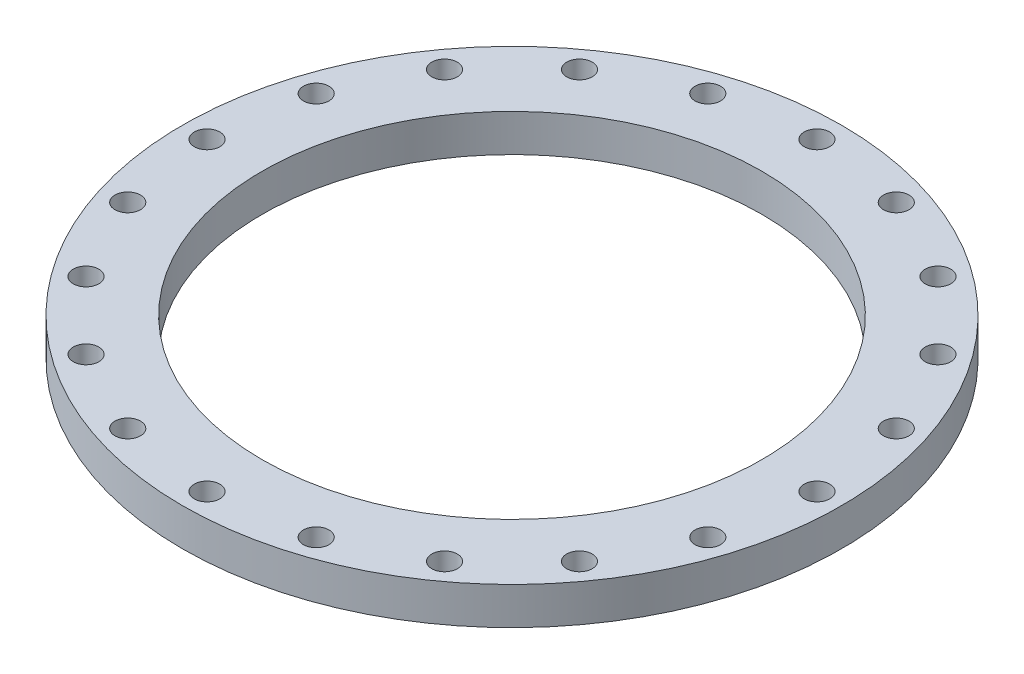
ISO-10303-21;
HEADER;
FILE_DESCRIPTION(('STEP AP214'),'2;1');
FILE_NAME('part.step','',(''),(''),'','','');
FILE_SCHEMA(('AUTOMOTIVE_DESIGN { 1 0 10303 214 1 1 1 1 }'));
ENDSEC;
DATA;
#1=APPLICATION_CONTEXT('core data for automotive mechanical design processes');
#2=APPLICATION_PROTOCOL_DEFINITION('international standard','automotive_design',2000,#1);
#3=PRODUCT_CONTEXT('',#1,'mechanical');
#4=PRODUCT('Part','Part','',(#3));
#5=PRODUCT_RELATED_PRODUCT_CATEGORY('part','',(#4));
#6=PRODUCT_DEFINITION_FORMATION('','',#4);
#7=PRODUCT_DEFINITION_CONTEXT('part definition',#1,'design');
#8=PRODUCT_DEFINITION('design','',#6,#7);
#9=PRODUCT_DEFINITION_SHAPE('','',#8);
#10=(LENGTH_UNIT() NAMED_UNIT(*) SI_UNIT(.MILLI.,.METRE.));
#11=(NAMED_UNIT(*) PLANE_ANGLE_UNIT() SI_UNIT($,.RADIAN.));
#12=(NAMED_UNIT(*) SI_UNIT($,.STERADIAN.) SOLID_ANGLE_UNIT());
#13=UNCERTAINTY_MEASURE_WITH_UNIT(LENGTH_MEASURE(1.E-05),#10,'distance_accuracy_value','');
#14=(GEOMETRIC_REPRESENTATION_CONTEXT(3) GLOBAL_UNCERTAINTY_ASSIGNED_CONTEXT((#13)) GLOBAL_UNIT_ASSIGNED_CONTEXT((#10,
#11,#12)) REPRESENTATION_CONTEXT('',''));
#15=CARTESIAN_POINT('',(0.,0.,0.));
#16=DIRECTION('',(0.,0.,1.));
#17=DIRECTION('',(1.,0.,0.));
#18=AXIS2_PLACEMENT_3D('',#15,#16,#17);
#19=CARTESIAN_POINT('',(0.,0.,0.));
#20=DIRECTION('',(0.,1.,0.));
#21=DIRECTION('',(0.,0.,1.));
#22=AXIS2_PLACEMENT_3D('',#19,#20,#21);
#23=CYLINDRICAL_SURFACE('',#22,335.);
#24=CARTESIAN_POINT('',(0.,0.,0.));
#25=DIRECTION('',(0.,1.,0.));
#26=DIRECTION('',(0.,0.,-1.));
#27=AXIS2_PLACEMENT_3D('',#24,#25,#26);
#28=CIRCLE('',#27,335.);
#29=CARTESIAN_POINT('',(0.,0.,-335.));
#30=VERTEX_POINT('',#29);
#31=EDGE_CURVE('E10',#30,#30,#28,.T.);
#32=ORIENTED_EDGE('',*,*,#31,.T.);
#33=EDGE_LOOP('',(#32));
#34=FACE_BOUND('',#33,.T.);
#35=CARTESIAN_POINT('',(0.,38.,0.));
#36=DIRECTION('',(0.,1.,0.));
#37=DIRECTION('',(0.,0.,-1.));
#38=AXIS2_PLACEMENT_3D('',#35,#36,#37);
#39=CIRCLE('',#38,335.);
#40=CARTESIAN_POINT('',(0.,38.,-335.));
#41=VERTEX_POINT('',#40);
#42=EDGE_CURVE('E34',#41,#41,#39,.T.);
#43=ORIENTED_EDGE('',*,*,#42,.F.);
#44=EDGE_LOOP('',(#43));
#45=FACE_BOUND('',#44,.T.);
#46=ADVANCED_FACE('F31',(#34,#45),#23,.T.);
#47=CARTESIAN_POINT('',(0.,0.,0.));
#48=DIRECTION('',(0.,-1.,0.));
#49=DIRECTION('',(0.,0.,-1.));
#50=AXIS2_PLACEMENT_3D('',#47,#48,#49);
#51=PLANE('',#50);
#52=CARTESIAN_POINT('',(0.,0.,0.));
#53=DIRECTION('',(0.,1.,0.));
#54=DIRECTION('',(0.,0.,-1.));
#55=AXIS2_PLACEMENT_3D('',#52,#53,#54);
#56=CIRCLE('',#55,254.);
#57=CARTESIAN_POINT('',(0.,0.,-254.));
#58=VERTEX_POINT('',#57);
#59=EDGE_CURVE('E160',#58,#58,#56,.T.);
#60=ORIENTED_EDGE('',*,*,#59,.T.);
#61=EDGE_LOOP('',(#60));
#62=FACE_BOUND('',#61,.T.);
#63=CARTESIAN_POINT('',(310.,0.,0.));
#64=DIRECTION('',(0.,1.,0.));
#65=DIRECTION('',(0.,0.,-1.));
#66=AXIS2_PLACEMENT_3D('',#63,#64,#65);
#67=CIRCLE('',#66,13.);
#68=CARTESIAN_POINT('',(310.,0.,-13.));
#69=VERTEX_POINT('',#68);
#70=EDGE_CURVE('E154',#69,#69,#67,.T.);
#71=ORIENTED_EDGE('',*,*,#70,.T.);
#72=EDGE_LOOP('',(#71));
#73=FACE_BOUND('',#72,.T.);
#74=CARTESIAN_POINT('',(294.827520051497,0.,-95.7952682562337));
#75=DIRECTION('',(0.,1.,0.));
#76=DIRECTION('',(0.,0.,-1.));
#77=AXIS2_PLACEMENT_3D('',#74,#75,#76);
#78=CIRCLE('',#77,13.);
#79=CARTESIAN_POINT('',(294.827520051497,0.,-108.795268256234));
#80=VERTEX_POINT('',#79);
#81=EDGE_CURVE('E148',#80,#80,#78,.T.);
#82=ORIENTED_EDGE('',*,*,#81,.T.);
#83=EDGE_LOOP('',(#82));
#84=FACE_BOUND('',#83,.T.);
#85=CARTESIAN_POINT('',(250.795268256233,0.,-182.213428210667));
#86=DIRECTION('',(0.,1.,0.));
#87=DIRECTION('',(0.,0.,-1.));
#88=AXIS2_PLACEMENT_3D('',#85,#86,#87);
#89=CIRCLE('',#88,13.);
#90=CARTESIAN_POINT('',(250.795268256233,0.,-195.213428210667));
#91=VERTEX_POINT('',#90);
#92=EDGE_CURVE('E142',#91,#91,#89,.T.);
#93=ORIENTED_EDGE('',*,*,#92,.T.);
#94=EDGE_LOOP('',(#93));
#95=FACE_BOUND('',#94,.T.);
#96=CARTESIAN_POINT('',(182.213428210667,0.,-250.795268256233));
#97=DIRECTION('',(0.,1.,0.));
#98=DIRECTION('',(0.,0.,-1.));
#99=AXIS2_PLACEMENT_3D('',#96,#97,#98);
#100=CIRCLE('',#99,13.);
#101=CARTESIAN_POINT('',(182.213428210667,0.,-263.795268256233));
#102=VERTEX_POINT('',#101);
#103=EDGE_CURVE('E136',#102,#102,#100,.T.);
#104=ORIENTED_EDGE('',*,*,#103,.T.);
#105=EDGE_LOOP('',(#104));
#106=FACE_BOUND('',#105,.T.);
#107=CARTESIAN_POINT('',(95.7952682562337,0.,-294.827520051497));
#108=DIRECTION('',(0.,1.,0.));
#109=DIRECTION('',(0.,0.,-1.));
#110=AXIS2_PLACEMENT_3D('',#107,#108,#109);
#111=CIRCLE('',#110,13.);
#112=CARTESIAN_POINT('',(95.7952682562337,0.,-307.827520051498));
#113=VERTEX_POINT('',#112);
#114=EDGE_CURVE('E130',#113,#113,#111,.T.);
#115=ORIENTED_EDGE('',*,*,#114,.T.);
#116=EDGE_LOOP('',(#115));
#117=FACE_BOUND('',#116,.T.);
#118=CARTESIAN_POINT('',(0.,0.,-310.));
#119=DIRECTION('',(0.,1.,0.));
#120=DIRECTION('',(0.,0.,-1.));
#121=AXIS2_PLACEMENT_3D('',#118,#119,#120);
#122=CIRCLE('',#121,13.);
#123=CARTESIAN_POINT('',(0.,0.,-323.));
#124=VERTEX_POINT('',#123);
#125=EDGE_CURVE('E124',#124,#124,#122,.T.);
#126=ORIENTED_EDGE('',*,*,#125,.T.);
#127=EDGE_LOOP('',(#126));
#128=FACE_BOUND('',#127,.T.);
#129=CARTESIAN_POINT('',(-95.7952682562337,0.,-294.827520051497));
#130=DIRECTION('',(0.,1.,0.));
#131=DIRECTION('',(0.,0.,-1.));
#132=AXIS2_PLACEMENT_3D('',#129,#130,#131);
#133=CIRCLE('',#132,13.);
#134=CARTESIAN_POINT('',(-95.7952682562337,0.,-307.827520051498));
#135=VERTEX_POINT('',#134);
#136=EDGE_CURVE('E118',#135,#135,#133,.T.);
#137=ORIENTED_EDGE('',*,*,#136,.T.);
#138=EDGE_LOOP('',(#137));
#139=FACE_BOUND('',#138,.T.);
#140=CARTESIAN_POINT('',(-182.213428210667,0.,-250.795268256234));
#141=DIRECTION('',(0.,1.,0.));
#142=DIRECTION('',(0.,0.,-1.));
#143=AXIS2_PLACEMENT_3D('',#140,#141,#142);
#144=CIRCLE('',#143,13.);
#145=CARTESIAN_POINT('',(-182.213428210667,0.,-263.795268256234));
#146=VERTEX_POINT('',#145);
#147=EDGE_CURVE('E112',#146,#146,#144,.T.);
#148=ORIENTED_EDGE('',*,*,#147,.T.);
#149=EDGE_LOOP('',(#148));
#150=FACE_BOUND('',#149,.T.);
#151=CARTESIAN_POINT('',(-250.795268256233,0.,-182.213428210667));
#152=DIRECTION('',(0.,1.,0.));
#153=DIRECTION('',(0.,0.,-1.));
#154=AXIS2_PLACEMENT_3D('',#151,#152,#153);
#155=CIRCLE('',#154,13.);
#156=CARTESIAN_POINT('',(-250.795268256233,0.,-195.213428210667));
#157=VERTEX_POINT('',#156);
#158=EDGE_CURVE('E106',#157,#157,#155,.T.);
#159=ORIENTED_EDGE('',*,*,#158,.T.);
#160=EDGE_LOOP('',(#159));
#161=FACE_BOUND('',#160,.T.);
#162=CARTESIAN_POINT('',(-294.827520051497,0.,-95.7952682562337));
#163=DIRECTION('',(0.,1.,0.));
#164=DIRECTION('',(0.,0.,-1.));
#165=AXIS2_PLACEMENT_3D('',#162,#163,#164);
#166=CIRCLE('',#165,13.);
#167=CARTESIAN_POINT('',(-294.827520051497,0.,-108.795268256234));
#168=VERTEX_POINT('',#167);
#169=EDGE_CURVE('E100',#168,#168,#166,.T.);
#170=ORIENTED_EDGE('',*,*,#169,.T.);
#171=EDGE_LOOP('',(#170));
#172=FACE_BOUND('',#171,.T.);
#173=CARTESIAN_POINT('',(-310.,0.,0.));
#174=DIRECTION('',(0.,1.,0.));
#175=DIRECTION('',(0.,0.,-1.));
#176=AXIS2_PLACEMENT_3D('',#173,#174,#175);
#177=CIRCLE('',#176,13.);
#178=CARTESIAN_POINT('',(-310.,0.,-13.));
#179=VERTEX_POINT('',#178);
#180=EDGE_CURVE('E94',#179,#179,#177,.T.);
#181=ORIENTED_EDGE('',*,*,#180,.T.);
#182=EDGE_LOOP('',(#181));
#183=FACE_BOUND('',#182,.T.);
#184=CARTESIAN_POINT('',(-294.827520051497,0.,95.7952682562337));
#185=DIRECTION('',(0.,1.,0.));
#186=DIRECTION('',(0.,0.,-1.));
#187=AXIS2_PLACEMENT_3D('',#184,#185,#186);
#188=CIRCLE('',#187,13.);
#189=CARTESIAN_POINT('',(-294.827520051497,0.,82.7952682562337));
#190=VERTEX_POINT('',#189);
#191=EDGE_CURVE('E88',#190,#190,#188,.T.);
#192=ORIENTED_EDGE('',*,*,#191,.T.);
#193=EDGE_LOOP('',(#192));
#194=FACE_BOUND('',#193,.T.);
#195=CARTESIAN_POINT('',(-250.795268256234,0.,182.213428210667));
#196=DIRECTION('',(0.,1.,0.));
#197=DIRECTION('',(0.,0.,-1.));
#198=AXIS2_PLACEMENT_3D('',#195,#196,#197);
#199=CIRCLE('',#198,13.);
#200=CARTESIAN_POINT('',(-250.795268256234,0.,169.213428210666));
#201=VERTEX_POINT('',#200);
#202=EDGE_CURVE('E82',#201,#201,#199,.T.);
#203=ORIENTED_EDGE('',*,*,#202,.T.);
#204=EDGE_LOOP('',(#203));
#205=FACE_BOUND('',#204,.T.);
#206=CARTESIAN_POINT('',(-182.213428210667,0.,250.795268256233));
#207=DIRECTION('',(0.,1.,0.));
#208=DIRECTION('',(0.,0.,-1.));
#209=AXIS2_PLACEMENT_3D('',#206,#207,#208);
#210=CIRCLE('',#209,13.);
#211=CARTESIAN_POINT('',(-182.213428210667,0.,237.795268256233));
#212=VERTEX_POINT('',#211);
#213=EDGE_CURVE('E76',#212,#212,#210,.T.);
#214=ORIENTED_EDGE('',*,*,#213,.T.);
#215=EDGE_LOOP('',(#214));
#216=FACE_BOUND('',#215,.T.);
#217=CARTESIAN_POINT('',(-95.7952682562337,0.,294.827520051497));
#218=DIRECTION('',(0.,1.,0.));
#219=DIRECTION('',(0.,0.,-1.));
#220=AXIS2_PLACEMENT_3D('',#217,#218,#219);
#221=CIRCLE('',#220,13.);
#222=CARTESIAN_POINT('',(-95.7952682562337,0.,281.827520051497));
#223=VERTEX_POINT('',#222);
#224=EDGE_CURVE('E70',#223,#223,#221,.T.);
#225=ORIENTED_EDGE('',*,*,#224,.T.);
#226=EDGE_LOOP('',(#225));
#227=FACE_BOUND('',#226,.T.);
#228=CARTESIAN_POINT('',(0.,0.,310.));
#229=DIRECTION('',(0.,1.,0.));
#230=DIRECTION('',(0.,0.,-1.));
#231=AXIS2_PLACEMENT_3D('',#228,#229,#230);
#232=CIRCLE('',#231,13.);
#233=CARTESIAN_POINT('',(0.,0.,297.));
#234=VERTEX_POINT('',#233);
#235=EDGE_CURVE('E64',#234,#234,#232,.T.);
#236=ORIENTED_EDGE('',*,*,#235,.T.);
#237=EDGE_LOOP('',(#236));
#238=FACE_BOUND('',#237,.T.);
#239=CARTESIAN_POINT('',(95.7952682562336,0.,294.827520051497));
#240=DIRECTION('',(0.,1.,0.));
#241=DIRECTION('',(0.,0.,-1.));
#242=AXIS2_PLACEMENT_3D('',#239,#240,#241);
#243=CIRCLE('',#242,13.);
#244=CARTESIAN_POINT('',(95.7952682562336,0.,281.827520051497));
#245=VERTEX_POINT('',#244);
#246=EDGE_CURVE('E58',#245,#245,#243,.T.);
#247=ORIENTED_EDGE('',*,*,#246,.T.);
#248=EDGE_LOOP('',(#247));
#249=FACE_BOUND('',#248,.T.);
#250=CARTESIAN_POINT('',(182.213428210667,0.,250.795268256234));
#251=DIRECTION('',(0.,1.,0.));
#252=DIRECTION('',(0.,0.,-1.));
#253=AXIS2_PLACEMENT_3D('',#250,#251,#252);
#254=CIRCLE('',#253,13.);
#255=CARTESIAN_POINT('',(182.213428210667,0.,237.795268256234));
#256=VERTEX_POINT('',#255);
#257=EDGE_CURVE('E52',#256,#256,#254,.T.);
#258=ORIENTED_EDGE('',*,*,#257,.T.);
#259=EDGE_LOOP('',(#258));
#260=FACE_BOUND('',#259,.T.);
#261=CARTESIAN_POINT('',(250.795268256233,0.,182.213428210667));
#262=DIRECTION('',(0.,1.,0.));
#263=DIRECTION('',(0.,0.,-1.));
#264=AXIS2_PLACEMENT_3D('',#261,#262,#263);
#265=CIRCLE('',#264,13.);
#266=CARTESIAN_POINT('',(250.795268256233,0.,169.213428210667));
#267=VERTEX_POINT('',#266);
#268=EDGE_CURVE('E46',#267,#267,#265,.T.);
#269=ORIENTED_EDGE('',*,*,#268,.T.);
#270=EDGE_LOOP('',(#269));
#271=FACE_BOUND('',#270,.T.);
#272=CARTESIAN_POINT('',(294.827520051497,0.,95.7952682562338));
#273=DIRECTION('',(0.,1.,0.));
#274=DIRECTION('',(0.,0.,-1.));
#275=AXIS2_PLACEMENT_3D('',#272,#273,#274);
#276=CIRCLE('',#275,13.);
#277=CARTESIAN_POINT('',(294.827520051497,0.,82.7952682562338));
#278=VERTEX_POINT('',#277);
#279=EDGE_CURVE('E41',#278,#278,#276,.T.);
#280=ORIENTED_EDGE('',*,*,#279,.T.);
#281=EDGE_LOOP('',(#280));
#282=FACE_BOUND('',#281,.T.);
#283=ORIENTED_EDGE('',*,*,#31,.F.);
#284=EDGE_LOOP('',(#283));
#285=FACE_BOUND('',#284,.T.);
#286=ADVANCED_FACE('F169',(#62,#73,#84,#95,#106,#117,#128,#139,#150,#161,#172,#183,#194,#205,
#216,#227,#238,#249,#260,#271,#282,#285),#51,.T.);
#287=CARTESIAN_POINT('',(0.,38.,0.));
#288=DIRECTION('',(0.,-1.,0.));
#289=DIRECTION('',(0.,0.,-1.));
#290=AXIS2_PLACEMENT_3D('',#287,#288,#289);
#291=PLANE('',#290);
#292=CARTESIAN_POINT('',(0.,38.,0.));
#293=DIRECTION('',(0.,1.,0.));
#294=DIRECTION('',(0.,0.,-1.));
#295=AXIS2_PLACEMENT_3D('',#292,#293,#294);
#296=CIRCLE('',#295,254.);
#297=CARTESIAN_POINT('',(0.,38.,-254.));
#298=VERTEX_POINT('',#297);
#299=EDGE_CURVE('E163',#298,#298,#296,.T.);
#300=ORIENTED_EDGE('',*,*,#299,.F.);
#301=EDGE_LOOP('',(#300));
#302=FACE_BOUND('',#301,.T.);
#303=CARTESIAN_POINT('',(310.,38.,0.));
#304=DIRECTION('',(0.,1.,0.));
#305=DIRECTION('',(0.,0.,-1.));
#306=AXIS2_PLACEMENT_3D('',#303,#304,#305);
#307=CIRCLE('',#306,13.);
#308=CARTESIAN_POINT('',(310.,38.,-13.));
#309=VERTEX_POINT('',#308);
#310=EDGE_CURVE('E157',#309,#309,#307,.T.);
#311=ORIENTED_EDGE('',*,*,#310,.F.);
#312=EDGE_LOOP('',(#311));
#313=FACE_BOUND('',#312,.T.);
#314=CARTESIAN_POINT('',(294.827520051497,38.,-95.7952682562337));
#315=DIRECTION('',(0.,1.,0.));
#316=DIRECTION('',(0.,0.,-1.));
#317=AXIS2_PLACEMENT_3D('',#314,#315,#316);
#318=CIRCLE('',#317,13.);
#319=CARTESIAN_POINT('',(294.827520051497,38.,-108.795268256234));
#320=VERTEX_POINT('',#319);
#321=EDGE_CURVE('E151',#320,#320,#318,.T.);
#322=ORIENTED_EDGE('',*,*,#321,.F.);
#323=EDGE_LOOP('',(#322));
#324=FACE_BOUND('',#323,.T.);
#325=CARTESIAN_POINT('',(250.795268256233,38.,-182.213428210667));
#326=DIRECTION('',(0.,1.,0.));
#327=DIRECTION('',(0.,0.,-1.));
#328=AXIS2_PLACEMENT_3D('',#325,#326,#327);
#329=CIRCLE('',#328,13.);
#330=CARTESIAN_POINT('',(250.795268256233,38.,-195.213428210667));
#331=VERTEX_POINT('',#330);
#332=EDGE_CURVE('E145',#331,#331,#329,.T.);
#333=ORIENTED_EDGE('',*,*,#332,.F.);
#334=EDGE_LOOP('',(#333));
#335=FACE_BOUND('',#334,.T.);
#336=CARTESIAN_POINT('',(182.213428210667,38.,-250.795268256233));
#337=DIRECTION('',(0.,1.,0.));
#338=DIRECTION('',(0.,0.,-1.));
#339=AXIS2_PLACEMENT_3D('',#336,#337,#338);
#340=CIRCLE('',#339,13.);
#341=CARTESIAN_POINT('',(182.213428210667,38.,-263.795268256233));
#342=VERTEX_POINT('',#341);
#343=EDGE_CURVE('E139',#342,#342,#340,.T.);
#344=ORIENTED_EDGE('',*,*,#343,.F.);
#345=EDGE_LOOP('',(#344));
#346=FACE_BOUND('',#345,.T.);
#347=CARTESIAN_POINT('',(95.7952682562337,38.,-294.827520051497));
#348=DIRECTION('',(0.,1.,0.));
#349=DIRECTION('',(0.,0.,-1.));
#350=AXIS2_PLACEMENT_3D('',#347,#348,#349);
#351=CIRCLE('',#350,13.);
#352=CARTESIAN_POINT('',(95.7952682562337,38.,-307.827520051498));
#353=VERTEX_POINT('',#352);
#354=EDGE_CURVE('E133',#353,#353,#351,.T.);
#355=ORIENTED_EDGE('',*,*,#354,.F.);
#356=EDGE_LOOP('',(#355));
#357=FACE_BOUND('',#356,.T.);
#358=CARTESIAN_POINT('',(0.,38.,-310.));
#359=DIRECTION('',(0.,1.,0.));
#360=DIRECTION('',(0.,0.,-1.));
#361=AXIS2_PLACEMENT_3D('',#358,#359,#360);
#362=CIRCLE('',#361,13.);
#363=CARTESIAN_POINT('',(0.,38.,-323.));
#364=VERTEX_POINT('',#363);
#365=EDGE_CURVE('E127',#364,#364,#362,.T.);
#366=ORIENTED_EDGE('',*,*,#365,.F.);
#367=EDGE_LOOP('',(#366));
#368=FACE_BOUND('',#367,.T.);
#369=CARTESIAN_POINT('',(-95.7952682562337,38.,-294.827520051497));
#370=DIRECTION('',(0.,1.,0.));
#371=DIRECTION('',(0.,0.,-1.));
#372=AXIS2_PLACEMENT_3D('',#369,#370,#371);
#373=CIRCLE('',#372,13.);
#374=CARTESIAN_POINT('',(-95.7952682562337,38.,-307.827520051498));
#375=VERTEX_POINT('',#374);
#376=EDGE_CURVE('E121',#375,#375,#373,.T.);
#377=ORIENTED_EDGE('',*,*,#376,.F.);
#378=EDGE_LOOP('',(#377));
#379=FACE_BOUND('',#378,.T.);
#380=CARTESIAN_POINT('',(-182.213428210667,38.,-250.795268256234));
#381=DIRECTION('',(0.,1.,0.));
#382=DIRECTION('',(0.,0.,-1.));
#383=AXIS2_PLACEMENT_3D('',#380,#381,#382);
#384=CIRCLE('',#383,13.);
#385=CARTESIAN_POINT('',(-182.213428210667,38.,-263.795268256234));
#386=VERTEX_POINT('',#385);
#387=EDGE_CURVE('E115',#386,#386,#384,.T.);
#388=ORIENTED_EDGE('',*,*,#387,.F.);
#389=EDGE_LOOP('',(#388));
#390=FACE_BOUND('',#389,.T.);
#391=CARTESIAN_POINT('',(-250.795268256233,38.,-182.213428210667));
#392=DIRECTION('',(0.,1.,0.));
#393=DIRECTION('',(0.,0.,-1.));
#394=AXIS2_PLACEMENT_3D('',#391,#392,#393);
#395=CIRCLE('',#394,13.);
#396=CARTESIAN_POINT('',(-250.795268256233,38.,-195.213428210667));
#397=VERTEX_POINT('',#396);
#398=EDGE_CURVE('E109',#397,#397,#395,.T.);
#399=ORIENTED_EDGE('',*,*,#398,.F.);
#400=EDGE_LOOP('',(#399));
#401=FACE_BOUND('',#400,.T.);
#402=CARTESIAN_POINT('',(-294.827520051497,38.,-95.7952682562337));
#403=DIRECTION('',(0.,1.,0.));
#404=DIRECTION('',(0.,0.,-1.));
#405=AXIS2_PLACEMENT_3D('',#402,#403,#404);
#406=CIRCLE('',#405,13.);
#407=CARTESIAN_POINT('',(-294.827520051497,38.,-108.795268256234));
#408=VERTEX_POINT('',#407);
#409=EDGE_CURVE('E103',#408,#408,#406,.T.);
#410=ORIENTED_EDGE('',*,*,#409,.F.);
#411=EDGE_LOOP('',(#410));
#412=FACE_BOUND('',#411,.T.);
#413=CARTESIAN_POINT('',(-310.,38.,0.));
#414=DIRECTION('',(0.,1.,0.));
#415=DIRECTION('',(0.,0.,-1.));
#416=AXIS2_PLACEMENT_3D('',#413,#414,#415);
#417=CIRCLE('',#416,13.);
#418=CARTESIAN_POINT('',(-310.,38.,-13.));
#419=VERTEX_POINT('',#418);
#420=EDGE_CURVE('E97',#419,#419,#417,.T.);
#421=ORIENTED_EDGE('',*,*,#420,.F.);
#422=EDGE_LOOP('',(#421));
#423=FACE_BOUND('',#422,.T.);
#424=CARTESIAN_POINT('',(-294.827520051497,38.,95.7952682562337));
#425=DIRECTION('',(0.,1.,0.));
#426=DIRECTION('',(0.,0.,-1.));
#427=AXIS2_PLACEMENT_3D('',#424,#425,#426);
#428=CIRCLE('',#427,13.);
#429=CARTESIAN_POINT('',(-294.827520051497,38.,82.7952682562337));
#430=VERTEX_POINT('',#429);
#431=EDGE_CURVE('E91',#430,#430,#428,.T.);
#432=ORIENTED_EDGE('',*,*,#431,.F.);
#433=EDGE_LOOP('',(#432));
#434=FACE_BOUND('',#433,.T.);
#435=CARTESIAN_POINT('',(-250.795268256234,38.,182.213428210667));
#436=DIRECTION('',(0.,1.,0.));
#437=DIRECTION('',(0.,0.,-1.));
#438=AXIS2_PLACEMENT_3D('',#435,#436,#437);
#439=CIRCLE('',#438,13.);
#440=CARTESIAN_POINT('',(-250.795268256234,38.,169.213428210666));
#441=VERTEX_POINT('',#440);
#442=EDGE_CURVE('E85',#441,#441,#439,.T.);
#443=ORIENTED_EDGE('',*,*,#442,.F.);
#444=EDGE_LOOP('',(#443));
#445=FACE_BOUND('',#444,.T.);
#446=CARTESIAN_POINT('',(-182.213428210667,38.,250.795268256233));
#447=DIRECTION('',(0.,1.,0.));
#448=DIRECTION('',(0.,0.,-1.));
#449=AXIS2_PLACEMENT_3D('',#446,#447,#448);
#450=CIRCLE('',#449,13.);
#451=CARTESIAN_POINT('',(-182.213428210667,38.,237.795268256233));
#452=VERTEX_POINT('',#451);
#453=EDGE_CURVE('E79',#452,#452,#450,.T.);
#454=ORIENTED_EDGE('',*,*,#453,.F.);
#455=EDGE_LOOP('',(#454));
#456=FACE_BOUND('',#455,.T.);
#457=CARTESIAN_POINT('',(-95.7952682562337,38.,294.827520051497));
#458=DIRECTION('',(0.,1.,0.));
#459=DIRECTION('',(0.,0.,-1.));
#460=AXIS2_PLACEMENT_3D('',#457,#458,#459);
#461=CIRCLE('',#460,13.);
#462=CARTESIAN_POINT('',(-95.7952682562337,38.,281.827520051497));
#463=VERTEX_POINT('',#462);
#464=EDGE_CURVE('E73',#463,#463,#461,.T.);
#465=ORIENTED_EDGE('',*,*,#464,.F.);
#466=EDGE_LOOP('',(#465));
#467=FACE_BOUND('',#466,.T.);
#468=CARTESIAN_POINT('',(0.,38.,310.));
#469=DIRECTION('',(0.,1.,0.));
#470=DIRECTION('',(0.,0.,-1.));
#471=AXIS2_PLACEMENT_3D('',#468,#469,#470);
#472=CIRCLE('',#471,13.);
#473=CARTESIAN_POINT('',(0.,38.,297.));
#474=VERTEX_POINT('',#473);
#475=EDGE_CURVE('E67',#474,#474,#472,.T.);
#476=ORIENTED_EDGE('',*,*,#475,.F.);
#477=EDGE_LOOP('',(#476));
#478=FACE_BOUND('',#477,.T.);
#479=CARTESIAN_POINT('',(95.7952682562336,38.,294.827520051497));
#480=DIRECTION('',(0.,1.,0.));
#481=DIRECTION('',(0.,0.,-1.));
#482=AXIS2_PLACEMENT_3D('',#479,#480,#481);
#483=CIRCLE('',#482,13.);
#484=CARTESIAN_POINT('',(95.7952682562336,38.,281.827520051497));
#485=VERTEX_POINT('',#484);
#486=EDGE_CURVE('E61',#485,#485,#483,.T.);
#487=ORIENTED_EDGE('',*,*,#486,.F.);
#488=EDGE_LOOP('',(#487));
#489=FACE_BOUND('',#488,.T.);
#490=CARTESIAN_POINT('',(182.213428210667,38.,250.795268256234));
#491=DIRECTION('',(0.,1.,0.));
#492=DIRECTION('',(0.,0.,-1.));
#493=AXIS2_PLACEMENT_3D('',#490,#491,#492);
#494=CIRCLE('',#493,13.);
#495=CARTESIAN_POINT('',(182.213428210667,38.,237.795268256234));
#496=VERTEX_POINT('',#495);
#497=EDGE_CURVE('E55',#496,#496,#494,.T.);
#498=ORIENTED_EDGE('',*,*,#497,.F.);
#499=EDGE_LOOP('',(#498));
#500=FACE_BOUND('',#499,.T.);
#501=CARTESIAN_POINT('',(250.795268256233,38.,182.213428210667));
#502=DIRECTION('',(0.,1.,0.));
#503=DIRECTION('',(0.,0.,-1.));
#504=AXIS2_PLACEMENT_3D('',#501,#502,#503);
#505=CIRCLE('',#504,13.);
#506=CARTESIAN_POINT('',(250.795268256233,38.,169.213428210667));
#507=VERTEX_POINT('',#506);
#508=EDGE_CURVE('E49',#507,#507,#505,.T.);
#509=ORIENTED_EDGE('',*,*,#508,.F.);
#510=EDGE_LOOP('',(#509));
#511=FACE_BOUND('',#510,.T.);
#512=CARTESIAN_POINT('',(294.827520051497,38.,95.7952682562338));
#513=DIRECTION('',(0.,1.,0.));
#514=DIRECTION('',(0.,0.,-1.));
#515=AXIS2_PLACEMENT_3D('',#512,#513,#514);
#516=CIRCLE('',#515,13.);
#517=CARTESIAN_POINT('',(294.827520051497,38.,82.7952682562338));
#518=VERTEX_POINT('',#517);
#519=EDGE_CURVE('E43',#518,#518,#516,.T.);
#520=ORIENTED_EDGE('',*,*,#519,.F.);
#521=EDGE_LOOP('',(#520));
#522=FACE_BOUND('',#521,.T.);
#523=ORIENTED_EDGE('',*,*,#42,.T.);
#524=EDGE_LOOP('',(#523));
#525=FACE_BOUND('',#524,.T.);
#526=ADVANCED_FACE('F179',(#302,#313,#324,#335,#346,#357,#368,#379,#390,#401,#412,#423,#434,
#445,#456,#467,#478,#489,#500,#511,#522,#525),#291,.F.);
#527=CARTESIAN_POINT('',(294.827520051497,0.,95.7952682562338));
#528=DIRECTION('',(0.,1.,0.));
#529=DIRECTION('',(0.,0.,1.));
#530=AXIS2_PLACEMENT_3D('',#527,#528,#529);
#531=CYLINDRICAL_SURFACE('',#530,13.);
#532=ORIENTED_EDGE('',*,*,#279,.F.);
#533=EDGE_LOOP('',(#532));
#534=FACE_BOUND('',#533,.T.);
#535=ORIENTED_EDGE('',*,*,#519,.T.);
#536=EDGE_LOOP('',(#535));
#537=FACE_BOUND('',#536,.T.);
#538=ADVANCED_FACE('F182',(#534,#537),#531,.F.);
#539=CARTESIAN_POINT('',(250.795268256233,0.,182.213428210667));
#540=DIRECTION('',(0.,1.,0.));
#541=DIRECTION('',(0.,0.,1.));
#542=AXIS2_PLACEMENT_3D('',#539,#540,#541);
#543=CYLINDRICAL_SURFACE('',#542,13.);
#544=ORIENTED_EDGE('',*,*,#268,.F.);
#545=EDGE_LOOP('',(#544));
#546=FACE_BOUND('',#545,.T.);
#547=ORIENTED_EDGE('',*,*,#508,.T.);
#548=EDGE_LOOP('',(#547));
#549=FACE_BOUND('',#548,.T.);
#550=ADVANCED_FACE('F235',(#546,#549),#543,.F.);
#551=CARTESIAN_POINT('',(182.213428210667,0.,250.795268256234));
#552=DIRECTION('',(0.,1.,0.));
#553=DIRECTION('',(0.,0.,1.));
#554=AXIS2_PLACEMENT_3D('',#551,#552,#553);
#555=CYLINDRICAL_SURFACE('',#554,13.);
#556=ORIENTED_EDGE('',*,*,#257,.F.);
#557=EDGE_LOOP('',(#556));
#558=FACE_BOUND('',#557,.T.);
#559=ORIENTED_EDGE('',*,*,#497,.T.);
#560=EDGE_LOOP('',(#559));
#561=FACE_BOUND('',#560,.T.);
#562=ADVANCED_FACE('F239',(#558,#561),#555,.F.);
#563=CARTESIAN_POINT('',(95.7952682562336,0.,294.827520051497));
#564=DIRECTION('',(0.,1.,0.));
#565=DIRECTION('',(0.,0.,1.));
#566=AXIS2_PLACEMENT_3D('',#563,#564,#565);
#567=CYLINDRICAL_SURFACE('',#566,13.);
#568=ORIENTED_EDGE('',*,*,#246,.F.);
#569=EDGE_LOOP('',(#568));
#570=FACE_BOUND('',#569,.T.);
#571=ORIENTED_EDGE('',*,*,#486,.T.);
#572=EDGE_LOOP('',(#571));
#573=FACE_BOUND('',#572,.T.);
#574=ADVANCED_FACE('F243',(#570,#573),#567,.F.);
#575=CARTESIAN_POINT('',(0.,0.,310.));
#576=DIRECTION('',(0.,1.,0.));
#577=DIRECTION('',(0.,0.,1.));
#578=AXIS2_PLACEMENT_3D('',#575,#576,#577);
#579=CYLINDRICAL_SURFACE('',#578,13.);
#580=ORIENTED_EDGE('',*,*,#235,.F.);
#581=EDGE_LOOP('',(#580));
#582=FACE_BOUND('',#581,.T.);
#583=ORIENTED_EDGE('',*,*,#475,.T.);
#584=EDGE_LOOP('',(#583));
#585=FACE_BOUND('',#584,.T.);
#586=ADVANCED_FACE('F247',(#582,#585),#579,.F.);
#587=CARTESIAN_POINT('',(-95.7952682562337,0.,294.827520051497));
#588=DIRECTION('',(0.,1.,0.));
#589=DIRECTION('',(0.,0.,1.));
#590=AXIS2_PLACEMENT_3D('',#587,#588,#589);
#591=CYLINDRICAL_SURFACE('',#590,13.);
#592=ORIENTED_EDGE('',*,*,#224,.F.);
#593=EDGE_LOOP('',(#592));
#594=FACE_BOUND('',#593,.T.);
#595=ORIENTED_EDGE('',*,*,#464,.T.);
#596=EDGE_LOOP('',(#595));
#597=FACE_BOUND('',#596,.T.);
#598=ADVANCED_FACE('F251',(#594,#597),#591,.F.);
#599=CARTESIAN_POINT('',(-182.213428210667,0.,250.795268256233));
#600=DIRECTION('',(0.,1.,0.));
#601=DIRECTION('',(0.,0.,1.));
#602=AXIS2_PLACEMENT_3D('',#599,#600,#601);
#603=CYLINDRICAL_SURFACE('',#602,13.);
#604=ORIENTED_EDGE('',*,*,#213,.F.);
#605=EDGE_LOOP('',(#604));
#606=FACE_BOUND('',#605,.T.);
#607=ORIENTED_EDGE('',*,*,#453,.T.);
#608=EDGE_LOOP('',(#607));
#609=FACE_BOUND('',#608,.T.);
#610=ADVANCED_FACE('F255',(#606,#609),#603,.F.);
#611=CARTESIAN_POINT('',(-250.795268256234,0.,182.213428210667));
#612=DIRECTION('',(0.,1.,0.));
#613=DIRECTION('',(0.,0.,1.));
#614=AXIS2_PLACEMENT_3D('',#611,#612,#613);
#615=CYLINDRICAL_SURFACE('',#614,13.);
#616=ORIENTED_EDGE('',*,*,#202,.F.);
#617=EDGE_LOOP('',(#616));
#618=FACE_BOUND('',#617,.T.);
#619=ORIENTED_EDGE('',*,*,#442,.T.);
#620=EDGE_LOOP('',(#619));
#621=FACE_BOUND('',#620,.T.);
#622=ADVANCED_FACE('F259',(#618,#621),#615,.F.);
#623=CARTESIAN_POINT('',(-294.827520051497,0.,95.7952682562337));
#624=DIRECTION('',(0.,1.,0.));
#625=DIRECTION('',(0.,0.,1.));
#626=AXIS2_PLACEMENT_3D('',#623,#624,#625);
#627=CYLINDRICAL_SURFACE('',#626,13.);
#628=ORIENTED_EDGE('',*,*,#191,.F.);
#629=EDGE_LOOP('',(#628));
#630=FACE_BOUND('',#629,.T.);
#631=ORIENTED_EDGE('',*,*,#431,.T.);
#632=EDGE_LOOP('',(#631));
#633=FACE_BOUND('',#632,.T.);
#634=ADVANCED_FACE('F263',(#630,#633),#627,.F.);
#635=CARTESIAN_POINT('',(-310.,0.,0.));
#636=DIRECTION('',(0.,1.,0.));
#637=DIRECTION('',(0.,0.,1.));
#638=AXIS2_PLACEMENT_3D('',#635,#636,#637);
#639=CYLINDRICAL_SURFACE('',#638,13.);
#640=ORIENTED_EDGE('',*,*,#180,.F.);
#641=EDGE_LOOP('',(#640));
#642=FACE_BOUND('',#641,.T.);
#643=ORIENTED_EDGE('',*,*,#420,.T.);
#644=EDGE_LOOP('',(#643));
#645=FACE_BOUND('',#644,.T.);
#646=ADVANCED_FACE('F267',(#642,#645),#639,.F.);
#647=CARTESIAN_POINT('',(-294.827520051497,0.,-95.7952682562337));
#648=DIRECTION('',(0.,1.,0.));
#649=DIRECTION('',(0.,0.,1.));
#650=AXIS2_PLACEMENT_3D('',#647,#648,#649);
#651=CYLINDRICAL_SURFACE('',#650,13.);
#652=ORIENTED_EDGE('',*,*,#169,.F.);
#653=EDGE_LOOP('',(#652));
#654=FACE_BOUND('',#653,.T.);
#655=ORIENTED_EDGE('',*,*,#409,.T.);
#656=EDGE_LOOP('',(#655));
#657=FACE_BOUND('',#656,.T.);
#658=ADVANCED_FACE('F271',(#654,#657),#651,.F.);
#659=CARTESIAN_POINT('',(-250.795268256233,0.,-182.213428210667));
#660=DIRECTION('',(0.,1.,0.));
#661=DIRECTION('',(0.,0.,1.));
#662=AXIS2_PLACEMENT_3D('',#659,#660,#661);
#663=CYLINDRICAL_SURFACE('',#662,13.);
#664=ORIENTED_EDGE('',*,*,#158,.F.);
#665=EDGE_LOOP('',(#664));
#666=FACE_BOUND('',#665,.T.);
#667=ORIENTED_EDGE('',*,*,#398,.T.);
#668=EDGE_LOOP('',(#667));
#669=FACE_BOUND('',#668,.T.);
#670=ADVANCED_FACE('F275',(#666,#669),#663,.F.);
#671=CARTESIAN_POINT('',(-182.213428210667,0.,-250.795268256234));
#672=DIRECTION('',(0.,1.,0.));
#673=DIRECTION('',(0.,0.,1.));
#674=AXIS2_PLACEMENT_3D('',#671,#672,#673);
#675=CYLINDRICAL_SURFACE('',#674,13.);
#676=ORIENTED_EDGE('',*,*,#147,.F.);
#677=EDGE_LOOP('',(#676));
#678=FACE_BOUND('',#677,.T.);
#679=ORIENTED_EDGE('',*,*,#387,.T.);
#680=EDGE_LOOP('',(#679));
#681=FACE_BOUND('',#680,.T.);
#682=ADVANCED_FACE('F279',(#678,#681),#675,.F.);
#683=CARTESIAN_POINT('',(-95.7952682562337,0.,-294.827520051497));
#684=DIRECTION('',(0.,1.,0.));
#685=DIRECTION('',(0.,0.,1.));
#686=AXIS2_PLACEMENT_3D('',#683,#684,#685);
#687=CYLINDRICAL_SURFACE('',#686,13.);
#688=ORIENTED_EDGE('',*,*,#136,.F.);
#689=EDGE_LOOP('',(#688));
#690=FACE_BOUND('',#689,.T.);
#691=ORIENTED_EDGE('',*,*,#376,.T.);
#692=EDGE_LOOP('',(#691));
#693=FACE_BOUND('',#692,.T.);
#694=ADVANCED_FACE('F283',(#690,#693),#687,.F.);
#695=CARTESIAN_POINT('',(0.,0.,-310.));
#696=DIRECTION('',(0.,1.,0.));
#697=DIRECTION('',(0.,0.,1.));
#698=AXIS2_PLACEMENT_3D('',#695,#696,#697);
#699=CYLINDRICAL_SURFACE('',#698,13.);
#700=ORIENTED_EDGE('',*,*,#125,.F.);
#701=EDGE_LOOP('',(#700));
#702=FACE_BOUND('',#701,.T.);
#703=ORIENTED_EDGE('',*,*,#365,.T.);
#704=EDGE_LOOP('',(#703));
#705=FACE_BOUND('',#704,.T.);
#706=ADVANCED_FACE('F287',(#702,#705),#699,.F.);
#707=CARTESIAN_POINT('',(95.7952682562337,0.,-294.827520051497));
#708=DIRECTION('',(0.,1.,0.));
#709=DIRECTION('',(0.,0.,1.));
#710=AXIS2_PLACEMENT_3D('',#707,#708,#709);
#711=CYLINDRICAL_SURFACE('',#710,13.);
#712=ORIENTED_EDGE('',*,*,#114,.F.);
#713=EDGE_LOOP('',(#712));
#714=FACE_BOUND('',#713,.T.);
#715=ORIENTED_EDGE('',*,*,#354,.T.);
#716=EDGE_LOOP('',(#715));
#717=FACE_BOUND('',#716,.T.);
#718=ADVANCED_FACE('F291',(#714,#717),#711,.F.);
#719=CARTESIAN_POINT('',(182.213428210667,0.,-250.795268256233));
#720=DIRECTION('',(0.,1.,0.));
#721=DIRECTION('',(0.,0.,1.));
#722=AXIS2_PLACEMENT_3D('',#719,#720,#721);
#723=CYLINDRICAL_SURFACE('',#722,13.);
#724=ORIENTED_EDGE('',*,*,#103,.F.);
#725=EDGE_LOOP('',(#724));
#726=FACE_BOUND('',#725,.T.);
#727=ORIENTED_EDGE('',*,*,#343,.T.);
#728=EDGE_LOOP('',(#727));
#729=FACE_BOUND('',#728,.T.);
#730=ADVANCED_FACE('F295',(#726,#729),#723,.F.);
#731=CARTESIAN_POINT('',(250.795268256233,0.,-182.213428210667));
#732=DIRECTION('',(0.,1.,0.));
#733=DIRECTION('',(0.,0.,1.));
#734=AXIS2_PLACEMENT_3D('',#731,#732,#733);
#735=CYLINDRICAL_SURFACE('',#734,13.);
#736=ORIENTED_EDGE('',*,*,#92,.F.);
#737=EDGE_LOOP('',(#736));
#738=FACE_BOUND('',#737,.T.);
#739=ORIENTED_EDGE('',*,*,#332,.T.);
#740=EDGE_LOOP('',(#739));
#741=FACE_BOUND('',#740,.T.);
#742=ADVANCED_FACE('F299',(#738,#741),#735,.F.);
#743=CARTESIAN_POINT('',(294.827520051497,0.,-95.7952682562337));
#744=DIRECTION('',(0.,1.,0.));
#745=DIRECTION('',(0.,0.,1.));
#746=AXIS2_PLACEMENT_3D('',#743,#744,#745);
#747=CYLINDRICAL_SURFACE('',#746,13.);
#748=ORIENTED_EDGE('',*,*,#81,.F.);
#749=EDGE_LOOP('',(#748));
#750=FACE_BOUND('',#749,.T.);
#751=ORIENTED_EDGE('',*,*,#321,.T.);
#752=EDGE_LOOP('',(#751));
#753=FACE_BOUND('',#752,.T.);
#754=ADVANCED_FACE('F303',(#750,#753),#747,.F.);
#755=CARTESIAN_POINT('',(310.,0.,0.));
#756=DIRECTION('',(0.,1.,0.));
#757=DIRECTION('',(0.,0.,1.));
#758=AXIS2_PLACEMENT_3D('',#755,#756,#757);
#759=CYLINDRICAL_SURFACE('',#758,13.);
#760=ORIENTED_EDGE('',*,*,#70,.F.);
#761=EDGE_LOOP('',(#760));
#762=FACE_BOUND('',#761,.T.);
#763=ORIENTED_EDGE('',*,*,#310,.T.);
#764=EDGE_LOOP('',(#763));
#765=FACE_BOUND('',#764,.T.);
#766=ADVANCED_FACE('F175',(#762,#765),#759,.F.);
#767=CARTESIAN_POINT('',(0.,0.,0.));
#768=DIRECTION('',(0.,1.,0.));
#769=DIRECTION('',(0.,0.,1.));
#770=AXIS2_PLACEMENT_3D('',#767,#768,#769);
#771=CYLINDRICAL_SURFACE('',#770,254.);
#772=ORIENTED_EDGE('',*,*,#59,.F.);
#773=EDGE_LOOP('',(#772));
#774=FACE_BOUND('',#773,.T.);
#775=ORIENTED_EDGE('',*,*,#299,.T.);
#776=EDGE_LOOP('',(#775));
#777=FACE_BOUND('',#776,.T.);
#778=ADVANCED_FACE('F172',(#774,#777),#771,.F.);
#779=CLOSED_SHELL('',(#46,#286,#526,#538,#550,#562,#574,#586,#598,#610,#622,#634,#646,#658,#670,
#682,#694,#706,#718,#730,#742,#754,#766,#778));
#780=MANIFOLD_SOLID_BREP('B2',#779);
#781=ADVANCED_BREP_SHAPE_REPRESENTATION('',(#18,#780),#14);
#782=SHAPE_DEFINITION_REPRESENTATION(#9,#781);
ENDSEC;
END-ISO-10303-21;
